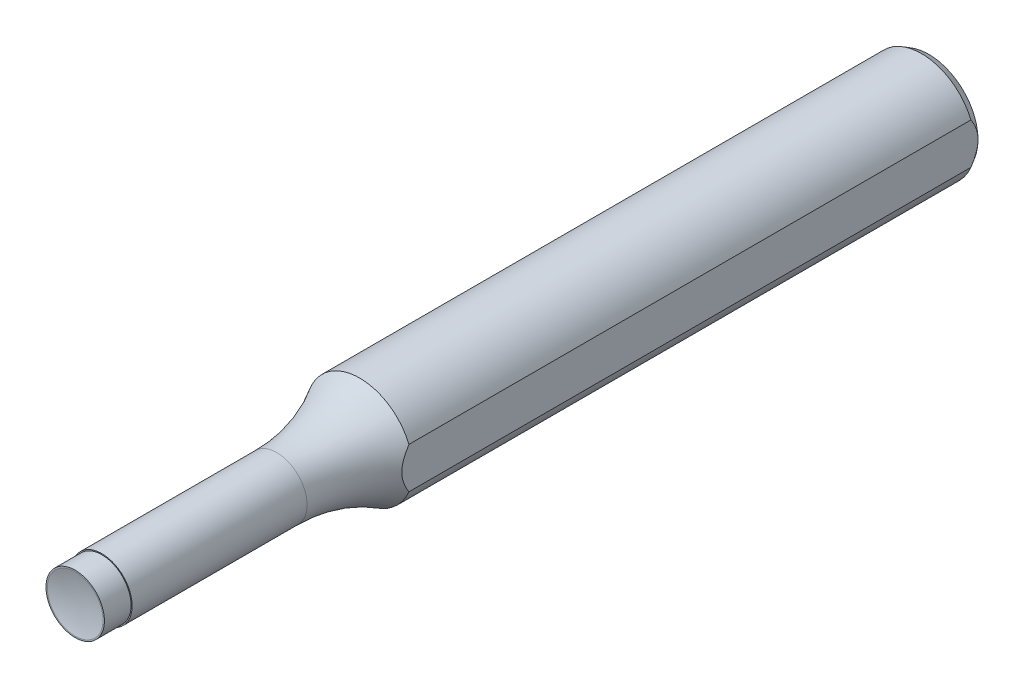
ISO-10303-21;
HEADER;
FILE_DESCRIPTION(('STEP AP214'),'2;1');
FILE_NAME('part.step','',(''),(''),'','','');
FILE_SCHEMA(('AUTOMOTIVE_DESIGN { 1 0 10303 214 1 1 1 1 }'));
ENDSEC;
DATA;
#1=APPLICATION_CONTEXT('core data for automotive mechanical design processes');
#2=APPLICATION_PROTOCOL_DEFINITION('international standard','automotive_design',2000,#1);
#3=PRODUCT_CONTEXT('',#1,'mechanical');
#4=PRODUCT('Part','Part','',(#3));
#5=PRODUCT_RELATED_PRODUCT_CATEGORY('part','',(#4));
#6=PRODUCT_DEFINITION_FORMATION('','',#4);
#7=PRODUCT_DEFINITION_CONTEXT('part definition',#1,'design');
#8=PRODUCT_DEFINITION('design','',#6,#7);
#9=PRODUCT_DEFINITION_SHAPE('','',#8);
#10=(LENGTH_UNIT() NAMED_UNIT(*) SI_UNIT(.MILLI.,.METRE.));
#11=(NAMED_UNIT(*) PLANE_ANGLE_UNIT() SI_UNIT($,.RADIAN.));
#12=(NAMED_UNIT(*) SI_UNIT($,.STERADIAN.) SOLID_ANGLE_UNIT());
#13=UNCERTAINTY_MEASURE_WITH_UNIT(LENGTH_MEASURE(1.E-05),#10,'distance_accuracy_value','');
#14=(GEOMETRIC_REPRESENTATION_CONTEXT(3) GLOBAL_UNCERTAINTY_ASSIGNED_CONTEXT((#13)) GLOBAL_UNIT_ASSIGNED_CONTEXT((#10,
#11,#12)) REPRESENTATION_CONTEXT('',''));
#15=CARTESIAN_POINT('',(0.,0.,0.));
#16=DIRECTION('',(0.,0.,1.));
#17=DIRECTION('',(1.,0.,0.));
#18=AXIS2_PLACEMENT_3D('',#15,#16,#17);
#19=CARTESIAN_POINT('',(0.,0.,-42.3333333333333));
#20=DIRECTION('',(0.,0.,1.));
#21=DIRECTION('',(1.,0.,0.));
#22=AXIS2_PLACEMENT_3D('',#19,#20,#21);
#23=CYLINDRICAL_SURFACE('',#22,4.5);
#24=CARTESIAN_POINT('',(0.,0.,-30.002558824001));
#25=DIRECTION('',(0.,0.,1.));
#26=DIRECTION('',(0.,-1.,0.));
#27=AXIS2_PLACEMENT_3D('',#24,#25,#26);
#28=CIRCLE('',#27,4.5);
#29=CARTESIAN_POINT('',(0.,-4.5,-30.002558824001));
#30=VERTEX_POINT('',#29);
#31=EDGE_CURVE('E79',#30,#30,#28,.F.);
#32=ORIENTED_EDGE('',*,*,#31,.F.);
#33=EDGE_LOOP('',(#32));
#34=FACE_BOUND('',#33,.T.);
#35=CARTESIAN_POINT('',(0.,0.,-3.97));
#36=DIRECTION('',(0.,0.,1.));
#37=DIRECTION('',(1.,0.,0.));
#38=AXIS2_PLACEMENT_3D('',#35,#36,#37);
#39=CIRCLE('',#38,4.5);
#40=CARTESIAN_POINT('',(4.5,0.,-3.97));
#41=VERTEX_POINT('',#40);
#42=EDGE_CURVE('E90',#41,#41,#39,.F.);
#43=ORIENTED_EDGE('',*,*,#42,.T.);
#44=EDGE_LOOP('',(#43));
#45=FACE_BOUND('',#44,.T.);
#46=ADVANCED_FACE('F42',(#34,#45),#23,.T.);
#47=CARTESIAN_POINT('',(0.,0.,-3.97));
#48=DIRECTION('',(0.,0.,1.));
#49=DIRECTION('',(1.,0.,0.));
#50=AXIS2_PLACEMENT_3D('',#47,#48,#49);
#51=PLANE('',#50);
#52=ORIENTED_EDGE('',*,*,#42,.F.);
#53=EDGE_LOOP('',(#52));
#54=FACE_BOUND('',#53,.T.);
#55=CARTESIAN_POINT('',(0.,0.,-3.97));
#56=DIRECTION('',(0.,0.,1.));
#57=DIRECTION('',(1.,0.,0.));
#58=AXIS2_PLACEMENT_3D('',#55,#56,#57);
#59=CIRCLE('',#58,4.35);
#60=CARTESIAN_POINT('',(4.35,0.,-3.97));
#61=VERTEX_POINT('',#60);
#62=EDGE_CURVE('E97',#61,#61,#59,.T.);
#63=ORIENTED_EDGE('',*,*,#62,.F.);
#64=EDGE_LOOP('',(#63));
#65=FACE_BOUND('',#64,.T.);
#66=ADVANCED_FACE('F111',(#54,#65),#51,.T.);
#67=CARTESIAN_POINT('',(0.,0.,-3.97));
#68=DIRECTION('',(0.,0.,1.));
#69=DIRECTION('',(1.,0.,0.));
#70=AXIS2_PLACEMENT_3D('',#67,#68,#69);
#71=CYLINDRICAL_SURFACE('',#70,4.35);
#72=ORIENTED_EDGE('',*,*,#62,.T.);
#73=EDGE_LOOP('',(#72));
#74=FACE_BOUND('',#73,.T.);
#75=CARTESIAN_POINT('',(0.,0.,0.));
#76=DIRECTION('',(0.,0.,1.));
#77=DIRECTION('',(1.,0.,0.));
#78=AXIS2_PLACEMENT_3D('',#75,#76,#77);
#79=CIRCLE('',#78,4.35);
#80=CARTESIAN_POINT('',(4.35,0.,0.));
#81=VERTEX_POINT('',#80);
#82=EDGE_CURVE('E123',#81,#81,#79,.T.);
#83=ORIENTED_EDGE('',*,*,#82,.F.);
#84=EDGE_LOOP('',(#83));
#85=FACE_BOUND('',#84,.T.);
#86=ADVANCED_FACE('F117',(#74,#85),#71,.T.);
#87=CARTESIAN_POINT('',(0.,0.,0.));
#88=DIRECTION('',(0.,0.,1.));
#89=DIRECTION('',(1.,0.,0.));
#90=AXIS2_PLACEMENT_3D('',#87,#88,#89);
#91=PLANE('',#90);
#92=CARTESIAN_POINT('',(0.,0.,0.));
#93=DIRECTION('',(0.,0.,1.));
#94=DIRECTION('',(0.,-1.,0.));
#95=AXIS2_PLACEMENT_3D('',#92,#93,#94);
#96=CIRCLE('',#95,4.15);
#97=CARTESIAN_POINT('',(0.,-4.15,0.));
#98=VERTEX_POINT('',#97);
#99=EDGE_CURVE('E126',#98,#98,#96,.T.);
#100=ORIENTED_EDGE('',*,*,#99,.F.);
#101=EDGE_LOOP('',(#100));
#102=FACE_BOUND('',#101,.T.);
#103=ORIENTED_EDGE('',*,*,#82,.T.);
#104=EDGE_LOOP('',(#103));
#105=FACE_BOUND('',#104,.T.);
#106=ADVANCED_FACE('F157',(#102,#105),#91,.T.);
#107=CARTESIAN_POINT('',(0.,0.,15.3281407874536));
#108=DIRECTION('',(0.,0.,1.));
#109=DIRECTION('',(0.,1.,0.));
#110=AXIS2_PLACEMENT_3D('',#107,#108,#109);
#111=SPHERICAL_SURFACE('',#110,15.88);
#112=ORIENTED_EDGE('',*,*,#99,.T.);
#113=EDGE_LOOP('',(#112));
#114=FACE_BOUND('',#113,.T.);
#115=ADVANCED_FACE('F160',(#114),#111,.F.);
#116=CARTESIAN_POINT('',(0.,0.,-30.002558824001));
#117=DIRECTION('',(0.,0.,-1.));
#118=DIRECTION('',(0.,1.,0.));
#119=AXIS2_PLACEMENT_3D('',#116,#117,#118);
#120=TOROIDAL_SURFACE('',#119,28.32,23.82);
#121=CARTESIAN_POINT('',(7.32877851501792,16.8166146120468,-51.6329941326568));
#122=CARTESIAN_POINT('',(7.32877851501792,16.5740885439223,-51.5304589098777));
#123=CARTESIAN_POINT('',(7.32877851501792,16.3329415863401,-51.4246996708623));
#124=CARTESIAN_POINT('',(7.32877851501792,15.8534937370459,-51.2069425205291));
#125=CARTESIAN_POINT('',(7.32877851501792,15.6151927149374,-51.0949448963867));
#126=CARTESIAN_POINT('',(7.32877851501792,14.9049020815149,-50.7500128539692));
#127=CARTESIAN_POINT('',(7.32877851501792,14.4372738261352,-50.5080327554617));
#128=CARTESIAN_POINT('',(7.32877851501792,13.5169206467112,-50.0033776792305));
#129=CARTESIAN_POINT('',(7.32877851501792,13.0641248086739,-49.7408313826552));
#130=CARTESIAN_POINT('',(7.32877851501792,12.1705924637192,-49.195905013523));
#131=CARTESIAN_POINT('',(7.32877851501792,11.7298571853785,-48.913522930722));
#132=CARTESIAN_POINT('',(7.32877851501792,10.8662481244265,-48.3355139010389));
#133=CARTESIAN_POINT('',(7.32877851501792,10.4432095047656,-48.0401322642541));
#134=CARTESIAN_POINT('',(7.32877851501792,9.60746407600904,-47.4351819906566));
#135=CARTESIAN_POINT('',(7.32877851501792,9.1947568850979,-47.1256138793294));
#136=CARTESIAN_POINT('',(7.32877851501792,8.58180020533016,-46.6529528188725));
#137=CARTESIAN_POINT('',(7.32877851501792,8.37838947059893,-46.4939253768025));
#138=CARTESIAN_POINT('',(7.32877851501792,7.97331646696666,-46.173657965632));
#139=CARTESIAN_POINT('',(7.32877851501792,7.7716541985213,-46.0124179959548));
#140=CARTESIAN_POINT('',(7.32877851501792,7.36964397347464,-45.6883046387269));
#141=CARTESIAN_POINT('',(7.32877851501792,7.16929604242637,-45.5254312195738));
#142=CARTESIAN_POINT('',(7.32877851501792,6.76936594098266,-45.1987485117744));
#143=CARTESIAN_POINT('',(7.32877851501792,6.56978377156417,-45.0349392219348));
#144=CARTESIAN_POINT('',(7.32877851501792,6.2470011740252,-44.7699078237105));
#145=CARTESIAN_POINT('',(7.32877851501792,6.12378116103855,-44.6687094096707));
#146=CARTESIAN_POINT('',(7.32877851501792,5.87716249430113,-44.466534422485));
#147=CARTESIAN_POINT('',(7.32877851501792,5.75376384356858,-44.3655578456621));
#148=CARTESIAN_POINT('',(7.32877851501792,5.38297899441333,-44.0633842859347));
#149=CARTESIAN_POINT('',(7.32877851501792,5.13498676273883,-43.8629292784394));
#150=CARTESIAN_POINT('',(7.32877851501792,4.63500844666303,-43.466864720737));
#151=CARTESIAN_POINT('',(7.32877851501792,4.3830214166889,-43.2712563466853));
#152=CARTESIAN_POINT('',(7.32877851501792,3.99974669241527,-42.9849603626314));
#153=CARTESIAN_POINT('',(7.32877851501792,3.87111968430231,-42.8907238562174));
#154=CARTESIAN_POINT('',(7.32877851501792,3.61159768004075,-42.7054362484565));
#155=CARTESIAN_POINT('',(7.32877851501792,3.48070286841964,-42.6143848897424));
#156=CARTESIAN_POINT('',(7.32877851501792,3.2114105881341,-42.4333127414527));
#157=CARTESIAN_POINT('',(7.32877851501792,3.07291146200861,-42.3434421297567));
#158=CARTESIAN_POINT('',(7.32877851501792,2.79225515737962,-42.1696387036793));
#159=CARTESIAN_POINT('',(7.32877851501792,2.65009879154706,-42.0857045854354));
#160=CARTESIAN_POINT('',(7.32877851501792,2.36157269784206,-41.9257073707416));
#161=CARTESIAN_POINT('',(7.32877851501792,2.21520793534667,-41.8496354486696));
#162=CARTESIAN_POINT('',(7.32877851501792,1.91769009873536,-41.7076617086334));
#163=CARTESIAN_POINT('',(7.32877851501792,1.76653861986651,-41.6417565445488));
#164=CARTESIAN_POINT('',(7.32877851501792,1.38290554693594,-41.4936033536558));
#165=CARTESIAN_POINT('',(7.32877851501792,1.14712279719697,-41.4193576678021));
#166=CARTESIAN_POINT('',(7.32877851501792,0.786985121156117,-41.3378394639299));
#167=CARTESIAN_POINT('',(7.32877851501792,0.665943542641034,-41.3156465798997));
#168=CARTESIAN_POINT('',(7.32877851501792,0.422329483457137,-41.282168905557));
#169=CARTESIAN_POINT('',(7.32877851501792,0.299757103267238,-41.2708834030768));
#170=CARTESIAN_POINT('',(7.32877851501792,0.0532785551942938,-41.2597972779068));
#171=CARTESIAN_POINT('',(7.32877851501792,-0.0706310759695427,-41.260072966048));
#172=CARTESIAN_POINT('',(7.32877851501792,-0.317868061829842,-41.2722788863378));
#173=CARTESIAN_POINT('',(7.32877851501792,-0.441195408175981,-41.2842092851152));
#174=CARTESIAN_POINT('',(7.32877851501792,-0.686356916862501,-41.3191014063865));
#175=CARTESIAN_POINT('',(7.32877851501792,-0.808189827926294,-41.342071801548));
#176=CARTESIAN_POINT('',(7.32877851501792,-1.04953902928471,-41.3979489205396));
#177=CARTESIAN_POINT('',(7.32877851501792,-1.16905492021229,-41.430857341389));
#178=CARTESIAN_POINT('',(7.32877851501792,-1.46683354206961,-41.5246632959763));
#179=CARTESIAN_POINT('',(7.32877851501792,-1.64331306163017,-41.5912153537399));
#180=CARTESIAN_POINT('',(7.32877851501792,-1.9897033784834,-41.7396003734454));
#181=CARTESIAN_POINT('',(7.32877851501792,-2.15960908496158,-41.8214449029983));
#182=CARTESIAN_POINT('',(7.32877851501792,-2.49444604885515,-41.9969918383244));
#183=CARTESIAN_POINT('',(7.32877851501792,-2.65934024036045,-42.0907641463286));
#184=CARTESIAN_POINT('',(7.32877851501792,-2.90279606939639,-42.2376834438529));
#185=CARTESIAN_POINT('',(7.32877851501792,-2.98328705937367,-42.2876909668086));
#186=CARTESIAN_POINT('',(7.32877851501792,-3.14311748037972,-42.3895038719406));
#187=CARTESIAN_POINT('',(7.32877851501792,-3.22245699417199,-42.4413091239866));
#188=CARTESIAN_POINT('',(7.32877851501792,-3.48502476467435,-42.6163978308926));
#189=CARTESIAN_POINT('',(7.32877851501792,-3.66600003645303,-42.7430586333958));
#190=CARTESIAN_POINT('',(7.32877851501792,-4.02388844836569,-43.0020133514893));
#191=CARTESIAN_POINT('',(7.32877851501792,-4.20080063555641,-43.1343085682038));
#192=CARTESIAN_POINT('',(7.32877851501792,-4.5518888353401,-43.4027488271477));
#193=CARTESIAN_POINT('',(7.32877851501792,-4.72606257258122,-43.5388968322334));
#194=CARTESIAN_POINT('',(7.32877851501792,-5.07251171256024,-43.8135441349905));
#195=CARTESIAN_POINT('',(7.32877851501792,-5.24478727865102,-43.9520432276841));
#196=CARTESIAN_POINT('',(7.32877851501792,-5.58865277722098,-44.2306726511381));
#197=CARTESIAN_POINT('',(7.32877851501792,-5.76024029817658,-44.3708059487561));
#198=CARTESIAN_POINT('',(7.32877851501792,-6.10299642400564,-44.6515878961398));
#199=CARTESIAN_POINT('',(7.32877851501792,-6.27416502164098,-44.7922365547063));
#200=CARTESIAN_POINT('',(7.32877851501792,-6.78771836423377,-45.21382118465));
#201=CARTESIAN_POINT('',(7.32877851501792,-7.1303008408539,-45.4945195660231));
#202=CARTESIAN_POINT('',(7.32877851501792,-7.81761381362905,-46.0500886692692));
#203=CARTESIAN_POINT('',(7.32877851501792,-8.16232748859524,-46.3249800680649));
#204=CARTESIAN_POINT('',(7.32877851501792,-8.85752379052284,-46.8674882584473));
#205=CARTESIAN_POINT('',(7.32877851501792,-9.20800709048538,-47.1351041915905));
#206=CARTESIAN_POINT('',(7.32877851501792,-9.91569955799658,-47.6605375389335));
#207=CARTESIAN_POINT('',(7.32877851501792,-10.2729012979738,-47.918364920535));
#208=CARTESIAN_POINT('',(7.32877851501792,-10.9952036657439,-48.4226637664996));
#209=CARTESIAN_POINT('',(7.32877851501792,-11.36030356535,-48.6691362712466));
#210=CARTESIAN_POINT('',(7.32877851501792,-12.1301745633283,-49.1694888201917));
#211=CARTESIAN_POINT('',(7.32877851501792,-12.535688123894,-49.4222305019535));
#212=CARTESIAN_POINT('',(7.32877851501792,-13.3568491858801,-49.9107747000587));
#213=CARTESIAN_POINT('',(7.32877851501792,-13.772497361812,-50.1465760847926));
#214=CARTESIAN_POINT('',(7.32877851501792,-14.62031431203,-50.6031466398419));
#215=CARTESIAN_POINT('',(7.32877851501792,-15.052639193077,-50.8236267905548));
#216=CARTESIAN_POINT('',(7.32877851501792,-15.927274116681,-51.2440765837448));
#217=CARTESIAN_POINT('',(7.32877851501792,-16.3695866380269,-51.444041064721));
#218=CARTESIAN_POINT('',(7.32877851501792,-16.8166146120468,-51.6329941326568));
#219=B_SPLINE_CURVE_WITH_KNOTS('',3,(#121,#122,#123,#124,#125,#126,#127,#128,#129,#130,#131,
#132,#133,#134,#135,#136,#137,#138,#139,#140,#141,#142,#143,#144,#145,#146,#147,#148,#149,#150,
#151,#152,#153,#154,#155,#156,#157,#158,#159,#160,#161,#162,#163,#164,#165,#166,#167,#168,#169,
#170,#171,#172,#173,#174,#175,#176,#177,#178,#179,#180,#181,#182,#183,#184,#185,#186,#187,#188,
#189,#190,#191,#192,#193,#194,#195,#196,#197,#198,#199,#200,#201,#202,#203,#204,#205,#206,#207,
#208,#209,#210,#211,#212,#213,#214,#215,#216,#217,#218),.UNSPECIFIED.,.F.,.F.,(4,2,2,2,2,2,2,2,
2,2,2,2,2,2,2,2,2,2,2,2,2,2,2,2,2,2,2,2,2,2,2,2,2,2,2,2,2,2,2,2,2,2,2,2,2,2,2,2,4),(0.,
0.789880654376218,1.57972497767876,3.15859640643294,4.72827608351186,6.29811506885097,
7.84564067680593,9.39310900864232,10.1676879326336,10.9422670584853,11.716861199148,
12.4914563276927,12.9698062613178,13.4481482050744,14.4047653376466,15.3616123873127,
15.8399368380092,16.318222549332,16.8134135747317,17.3084954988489,17.8030154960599,
18.2973723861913,19.0358653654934,19.4046280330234,19.7733666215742,20.1445394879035,
20.5157176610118,20.8871878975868,21.2587216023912,21.8235348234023,22.388777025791,
22.9574992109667,23.2417635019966,23.5260072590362,24.188510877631,24.8511683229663,
25.5143500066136,26.1774741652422,26.8420888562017,27.506714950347,28.8353833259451,
30.1580175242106,31.4808071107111,32.8022114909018,34.1234945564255,35.5565965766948,
36.9897942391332,38.4451659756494,39.9009029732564),.UNSPECIFIED.);
#220=CARTESIAN_POINT('',(7.32877851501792,3.05493133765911,-42.3333333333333));
#221=VERTEX_POINT('',#220);
#222=CARTESIAN_POINT('',(7.32877851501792,-3.05493133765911,-42.3333333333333));
#223=VERTEX_POINT('',#222);
#224=EDGE_CURVE('E58',#221,#223,#219,.T.);
#225=ORIENTED_EDGE('',*,*,#224,.F.);
#226=CARTESIAN_POINT('',(0.,0.,-42.3333333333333));
#227=DIRECTION('',(0.,0.,-1.));
#228=DIRECTION('',(0.,1.,0.));
#229=AXIS2_PLACEMENT_3D('',#226,#227,#228);
#230=CIRCLE('',#229,7.94);
#231=EDGE_CURVE('E131',#223,#221,#230,.T.);
#232=ORIENTED_EDGE('',*,*,#231,.F.);
#233=EDGE_LOOP('',(#225,#232));
#234=FACE_BOUND('',#233,.T.);
#235=ORIENTED_EDGE('',*,*,#31,.T.);
#236=EDGE_LOOP('',(#235));
#237=FACE_BOUND('',#236,.T.);
#238=ADVANCED_FACE('F107',(#234,#237),#120,.F.);
#239=CARTESIAN_POINT('',(0.,0.,-127.));
#240=DIRECTION('',(0.,0.,1.));
#241=DIRECTION('',(1.,0.,0.));
#242=AXIS2_PLACEMENT_3D('',#239,#240,#241);
#243=PLANE('',#242);
#244=CARTESIAN_POINT('',(0.,0.,-127.));
#245=DIRECTION('',(0.,0.,1.));
#246=DIRECTION('',(1.,0.,0.));
#247=AXIS2_PLACEMENT_3D('',#244,#245,#246);
#248=CIRCLE('',#247,7.32877851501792);
#249=CARTESIAN_POINT('',(7.32877851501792,0.,-127.));
#250=VERTEX_POINT('',#249);
#251=EDGE_CURVE('E85',#250,#250,#248,.F.);
#252=ORIENTED_EDGE('',*,*,#251,.T.);
#253=EDGE_LOOP('',(#252));
#254=FACE_BOUND('',#253,.T.);
#255=ADVANCED_FACE('F155',(#254),#243,.F.);
#256=CARTESIAN_POINT('',(0.,0.,-125.941333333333));
#257=DIRECTION('',(0.,0.,1.));
#258=DIRECTION('',(1.,0.,0.));
#259=AXIS2_PLACEMENT_3D('',#256,#257,#258);
#260=CONICAL_SURFACE('',#259,7.94,0.523598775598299);
#261=CARTESIAN_POINT('',(7.32877851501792,-8.88843113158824,-119.740230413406));
#262=CARTESIAN_POINT('',(7.32877851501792,-8.73080406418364,-119.950851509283));
#263=CARTESIAN_POINT('',(7.32877851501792,-8.57211012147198,-120.160681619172));
#264=CARTESIAN_POINT('',(7.32877851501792,-8.2522191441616,-120.578457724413));
#265=CARTESIAN_POINT('',(7.32877851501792,-8.09102185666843,-120.786403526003));
#266=CARTESIAN_POINT('',(7.32877851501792,-7.76533800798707,-121.200636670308));
#267=CARTESIAN_POINT('',(7.32877851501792,-7.60084359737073,-121.406917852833));
#268=CARTESIAN_POINT('',(7.32877851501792,-7.26855482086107,-121.816797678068));
#269=CARTESIAN_POINT('',(7.32877851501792,-7.10076056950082,-122.020396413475));
#270=CARTESIAN_POINT('',(7.32877851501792,-6.75953587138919,-122.426496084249));
#271=CARTESIAN_POINT('',(7.32877851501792,-6.5860646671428,-122.628962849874));
#272=CARTESIAN_POINT('',(7.32877851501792,-6.2345106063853,-123.029849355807));
#273=CARTESIAN_POINT('',(7.32877851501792,-6.05642794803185,-123.228269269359));
#274=CARTESIAN_POINT('',(7.32877851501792,-5.69497835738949,-123.619871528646));
#275=CARTESIAN_POINT('',(7.32877851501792,-5.51161708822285,-123.813059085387));
#276=CARTESIAN_POINT('',(7.32877851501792,-5.13840554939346,-124.193037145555));
#277=CARTESIAN_POINT('',(7.32877851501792,-4.94855643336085,-124.379828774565));
#278=CARTESIAN_POINT('',(7.32877851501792,-4.6185619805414,-124.690909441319));
#279=CARTESIAN_POINT('',(7.32877851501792,-4.48039232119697,-124.817291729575));
#280=CARTESIAN_POINT('',(7.32877851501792,-4.19962787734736,-125.065084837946));
#281=CARTESIAN_POINT('',(7.32877851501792,-4.05703278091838,-125.186495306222));
#282=CARTESIAN_POINT('',(7.32877851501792,-3.76656482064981,-125.423404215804));
#283=CARTESIAN_POINT('',(7.32877851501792,-3.6186830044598,-125.538891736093));
#284=CARTESIAN_POINT('',(7.32877851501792,-3.31722208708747,-125.762227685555));
#285=CARTESIAN_POINT('',(7.32877851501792,-3.16364295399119,-125.870076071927));
#286=CARTESIAN_POINT('',(7.32877851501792,-2.8476171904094,-126.077847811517));
#287=CARTESIAN_POINT('',(7.32877851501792,-2.68506781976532,-126.177616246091));
#288=CARTESIAN_POINT('',(7.32877851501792,-2.3528177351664,-126.364667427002));
#289=CARTESIAN_POINT('',(7.32877851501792,-2.18311574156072,-126.451947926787));
#290=CARTESIAN_POINT('',(7.32877851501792,-1.83724775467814,-126.610376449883));
#291=CARTESIAN_POINT('',(7.32877851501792,-1.66111710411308,-126.681600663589));
#292=CARTESIAN_POINT('',(7.32877851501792,-1.3022419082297,-126.804750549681));
#293=CARTESIAN_POINT('',(7.32877851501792,-1.11950321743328,-126.856692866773));
#294=CARTESIAN_POINT('',(7.32877851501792,-0.813030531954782,-126.923831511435));
#295=CARTESIAN_POINT('',(7.32877851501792,-0.690702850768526,-126.945522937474));
#296=CARTESIAN_POINT('',(7.32877851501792,-0.444657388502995,-126.978429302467));
#297=CARTESIAN_POINT('',(7.32877851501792,-0.320940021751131,-126.989647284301));
#298=CARTESIAN_POINT('',(7.32877851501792,-0.073012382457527,-127.001184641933));
#299=CARTESIAN_POINT('',(7.32877851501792,0.0511978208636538,-127.001505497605));
#300=CARTESIAN_POINT('',(7.32877851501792,0.299168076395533,-126.991242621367));
#301=CARTESIAN_POINT('',(7.32877851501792,0.422928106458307,-126.980658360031));
#302=CARTESIAN_POINT('',(7.32877851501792,0.668575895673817,-126.949047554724));
#303=CARTESIAN_POINT('',(7.32877851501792,0.790469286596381,-126.928064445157));
#304=CARTESIAN_POINT('',(7.32877851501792,1.03220206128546,-126.876404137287));
#305=CARTESIAN_POINT('',(7.32877851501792,1.15204057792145,-126.845722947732));
#306=CARTESIAN_POINT('',(7.32877851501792,1.50769171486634,-126.740480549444));
#307=CARTESIAN_POINT('',(7.32877851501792,1.73965666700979,-126.652718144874));
#308=CARTESIAN_POINT('',(7.32877851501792,2.17012243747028,-126.45964290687));
#309=CARTESIAN_POINT('',(7.32877851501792,2.36973261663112,-126.356709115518));
#310=CARTESIAN_POINT('',(7.32877851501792,2.75934848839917,-126.133817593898));
#311=CARTESIAN_POINT('',(7.32877851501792,2.9493454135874,-126.0138446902));
#312=CARTESIAN_POINT('',(7.32877851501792,3.32222206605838,-125.759850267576));
#313=CARTESIAN_POINT('',(7.32877851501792,3.50501774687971,-125.625706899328));
#314=CARTESIAN_POINT('',(7.32877851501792,3.86268505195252,-125.347474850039));
#315=CARTESIAN_POINT('',(7.32877851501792,4.03755997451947,-125.203390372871));
#316=CARTESIAN_POINT('',(7.32877851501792,4.43901655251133,-124.857102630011));
#317=CARTESIAN_POINT('',(7.32877851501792,4.66292739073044,-124.65181624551));
#318=CARTESIAN_POINT('',(7.32877851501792,5.10105623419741,-124.231095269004));
#319=CARTESIAN_POINT('',(7.32877851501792,5.31527068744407,-124.015657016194));
#320=CARTESIAN_POINT('',(7.32877851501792,5.73618445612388,-123.576758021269));
#321=CARTESIAN_POINT('',(7.32877851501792,5.94286768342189,-123.353281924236));
#322=CARTESIAN_POINT('',(7.32877851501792,6.34971215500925,-122.90046420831));
#323=CARTESIAN_POINT('',(7.32877851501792,6.54987289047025,-122.671122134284));
#324=CARTESIAN_POINT('',(7.32877851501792,6.93408307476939,-122.220381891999));
#325=CARTESIAN_POINT('',(7.32877851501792,7.11841797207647,-121.999226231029));
#326=CARTESIAN_POINT('',(7.32877851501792,7.48300213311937,-121.553559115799));
#327=CARTESIAN_POINT('',(7.32877851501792,7.66325117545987,-121.329047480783));
#328=CARTESIAN_POINT('',(7.32877851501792,8.01935572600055,-120.878424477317));
#329=CARTESIAN_POINT('',(7.32877851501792,8.1952289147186,-120.652327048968));
#330=CARTESIAN_POINT('',(7.32877851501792,8.54396458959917,-120.197873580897));
#331=CARTESIAN_POINT('',(7.32877851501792,8.71682751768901,-119.969517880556));
#332=CARTESIAN_POINT('',(7.32877851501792,8.88843113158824,-119.740230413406));
#333=B_SPLINE_CURVE_WITH_KNOTS('',3,(#261,#262,#263,#264,#265,#266,#267,#268,#269,#270,#271,
#272,#273,#274,#275,#276,#277,#278,#279,#280,#281,#282,#283,#284,#285,#286,#287,#288,#289,#290,
#291,#292,#293,#294,#295,#296,#297,#298,#299,#300,#301,#302,#303,#304,#305,#306,#307,#308,#309,
#310,#311,#312,#313,#314,#315,#316,#317,#318,#319,#320,#321,#322,#323,#324,#325,#326,#327,#328,
#329,#330,#331,#332),.UNSPECIFIED.,.F.,.F.,(4,2,2,2,2,2,2,2,2,2,2,2,2,2,2,2,2,2,2,2,2,2,2,2,2,2,
2,2,2,2,2,2,2,2,2,4),(0.,0.789225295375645,1.57853084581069,2.37001454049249,3.16147081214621,
3.96126621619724,4.76102730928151,5.55996020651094,6.35875177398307,6.92041249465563,
7.48211289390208,8.04481426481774,8.60751878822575,9.17925174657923,9.75108742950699,
10.3201496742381,10.8887195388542,11.2610272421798,11.6332267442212,12.0053756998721,
12.3775427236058,12.7481682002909,13.118946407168,13.8604526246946,14.5332661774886,
15.2066826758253,15.8864517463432,16.5659350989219,17.4768018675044,18.3879996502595,
19.3010416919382,20.2141547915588,21.0778126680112,21.9415172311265,22.8008298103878,
23.6600151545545),.UNSPECIFIED.);
#334=CARTESIAN_POINT('',(7.32877851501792,-3.05493133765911,-125.941333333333));
#335=VERTEX_POINT('',#334);
#336=EDGE_CURVE('E73',#335,#250,#333,.T.);
#337=ORIENTED_EDGE('',*,*,#336,.F.);
#338=CARTESIAN_POINT('',(0.,0.,-125.941333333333));
#339=DIRECTION('',(0.,0.,1.));
#340=DIRECTION('',(1.,0.,0.));
#341=AXIS2_PLACEMENT_3D('',#338,#339,#340);
#342=CIRCLE('',#341,7.94);
#343=CARTESIAN_POINT('',(7.32877851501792,3.05493133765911,-125.941333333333));
#344=VERTEX_POINT('',#343);
#345=EDGE_CURVE('E83',#344,#335,#342,.T.);
#346=ORIENTED_EDGE('',*,*,#345,.F.);
#347=EDGE_CURVE('E64',#250,#344,#333,.T.);
#348=ORIENTED_EDGE('',*,*,#347,.F.);
#349=ORIENTED_EDGE('',*,*,#251,.F.);
#350=EDGE_LOOP('',(#337,#346,#348,#349));
#351=FACE_BOUND('',#350,.T.);
#352=ADVANCED_FACE('F44',(#351),#260,.T.);
#353=CARTESIAN_POINT('',(0.,0.,-127.));
#354=DIRECTION('',(0.,0.,1.));
#355=DIRECTION('',(1.,0.,0.));
#356=AXIS2_PLACEMENT_3D('',#353,#354,#355);
#357=CYLINDRICAL_SURFACE('',#356,7.94);
#358=DIRECTION('',(0.,0.,1.));
#359=VECTOR('',#358,1.);
#360=CARTESIAN_POINT('',(7.32877851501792,3.05493133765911,-127.));
#361=LINE('',#360,#359);
#362=EDGE_CURVE('E13',#344,#221,#361,.T.);
#363=ORIENTED_EDGE('',*,*,#362,.F.);
#364=ORIENTED_EDGE('',*,*,#345,.T.);
#365=DIRECTION('',(0.,0.,1.));
#366=VECTOR('',#365,1.);
#367=CARTESIAN_POINT('',(7.32877851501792,-3.05493133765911,-127.));
#368=LINE('',#367,#366);
#369=EDGE_CURVE('E52',#223,#335,#368,.F.);
#370=ORIENTED_EDGE('',*,*,#369,.F.);
#371=ORIENTED_EDGE('',*,*,#231,.T.);
#372=EDGE_LOOP('',(#363,#364,#370,#371));
#373=FACE_BOUND('',#372,.T.);
#374=ADVANCED_FACE('F88',(#373),#357,.T.);
#375=CARTESIAN_POINT('',(7.32877851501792,3.05493133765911,0.));
#376=DIRECTION('',(-1.,0.,0.));
#377=DIRECTION('',(0.,0.,1.));
#378=AXIS2_PLACEMENT_3D('',#375,#376,#377);
#379=PLANE('',#378);
#380=ORIENTED_EDGE('',*,*,#224,.T.);
#381=ORIENTED_EDGE('',*,*,#369,.T.);
#382=ORIENTED_EDGE('',*,*,#336,.T.);
#383=ORIENTED_EDGE('',*,*,#347,.T.);
#384=ORIENTED_EDGE('',*,*,#362,.T.);
#385=EDGE_LOOP('',(#380,#381,#382,#383,#384));
#386=FACE_BOUND('',#385,.T.);
#387=ADVANCED_FACE('F72',(#386),#379,.F.);
#388=CLOSED_SHELL('',(#46,#66,#86,#106,#115,#238,#255,#352,#374,#387));
#389=MANIFOLD_SOLID_BREP('B2',#388);
#390=ADVANCED_BREP_SHAPE_REPRESENTATION('',(#18,#389),#14);
#391=SHAPE_DEFINITION_REPRESENTATION(#9,#390);
ENDSEC;
END-ISO-10303-21;
